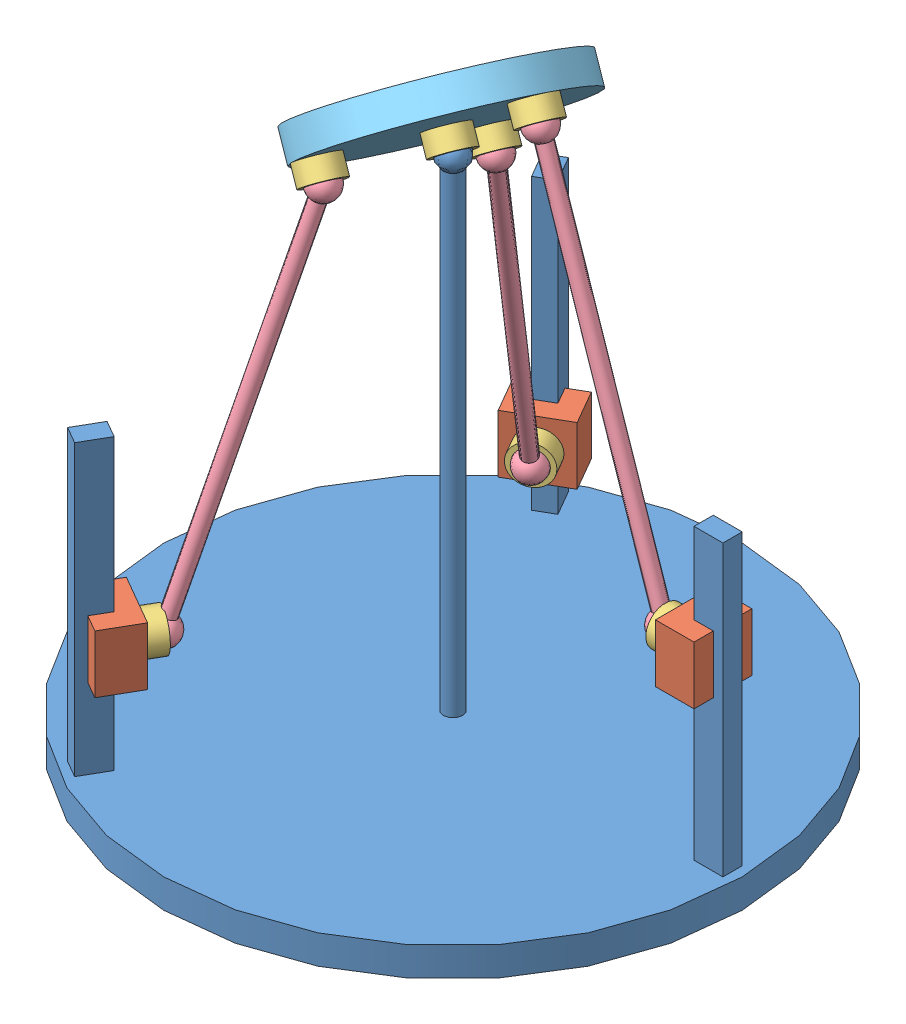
SolidWorks assembly 3Dchmech.SLDASM, configuration ﾃﾞﾌｫﾙﾄ (file format 4400). Lengths in mm.
Overall size (600 673.39 600).
16 component instances, 5 part files, 19 mates.
Components (placement in the parent):
- Base-1: Base.SLDPRT [ﾃﾞﾌｫﾙﾄ] at (-44.9776 -329.6553 0) size (600 545 600)
- Slider-1: Slider.SLDPRT [ﾃﾞﾌｫﾙﾄ] at (-190.9583 -156.9636 192.8461) x (0.866025 0 0.5) z (0 -1 0) size (60 40 60)
- Slider-2: Slider.SLDPRT [ﾃﾞﾌｫﾙﾄ] at (-190.9583 -259.8836 -192.8461) x (0.866025 0 -0.5) z (0 1 0) size (60 40 60)
- Slider-3: Slider.SLDPRT [ﾃﾞﾌｫﾙﾄ] at (195.0224 -83.6858 30) x (0 0 -1) z (0 -1 0) size (60 40 60)
- Pivot-1: Pivot.SLDPRT [ﾃﾞﾌｫﾙﾄ] at (-169.9776 -229.8836 -216.5064) x (0.366012 -0.9063 -0.211317) z (-0.784879 -0.422634 0.45315) size (40 30 40)
- Pivot-2: Pivot.SLDPRT [ﾃﾞﾌｫﾙﾄ] at (-169.9776 -186.9636 216.5064) x (-0.688455 -0.606662 -0.39748) z (0.525385 -0.79496 0.303331) size (40 30 40)
- Pivot-3: Pivot.SLDPRT [ﾃﾞﾌｫﾙﾄ] at (205.0224 -113.6858 0) x (0 1 0) z (0 0 1) size (40 30 40)
- Rod-4: Rod.SLDPRT [ﾃﾞﾌｫﾙﾄ] at (-154.9084 -186.9636 190.4057) x (0.846146 -0.265115 -0.462333) z (0.508445 0.141525 0.849384) size (30 430 30)
- Rod-5: Rod.SLDPRT [ﾃﾞﾌｫﾙﾄ] at (174.884 -113.6858 0) x (0.77564 0.274521 -0.568349) z (0.523866 0.222265 0.822291) size (30 430 30)
- Rod-6: Rod.SLDPRT [ﾃﾞﾌｫﾙﾄ] at (-154.9084 -229.8836 -190.4057) x (0.91735 -0.2746 0.288208) z (-0.348549 -0.204307 0.914752) size (30 430 30)
- Movingplate-1: Movingplate.SLDASM [ﾃﾞﾌｫﾙﾄ] at (-128.1031 258.7204 3.5111) x (-0.653789 -0.280732 0.702673) z (-0.45045 -0.601762 -0.659528) size (242.17 50 246.74)
  - Movingplate-1: Movingplate.SLDPRT [ﾃﾞﾌｫﾙﾄ] at (-40.4258 -73.1121 0) size (240 30 240)
  - Pivot-1: Pivot.SLDPRT [ﾃﾞﾌｫﾙﾄ] at (53.5434 -63.1121 -34.202) x (-0.760585 0 -0.649239) z (-0.649239 0 0.760585) size (40 30 40)
  - Pivot-2: Pivot.SLDPRT [ﾃﾞﾌｫﾙﾄ] at (-57.7906 -63.1121 98.4808) x (-0.73699 0 -0.675903) z (-0.675903 0 0.73699) size (40 30 40)
  - Pivot-3: Pivot.SLDPRT [ﾃﾞﾌｫﾙﾄ] at (-117.0303 -63.1121 -64.2788) x (-0.704167 0 0.710034) z (0.710034 0 0.704167) size (40 30 40)
  - Pivot-4: Pivot.SLDPRT [ﾃﾞﾌｫﾙﾄ] at (-40.4258 -63.1121 0) x (-0.837169 0 -0.546944) z (-0.546944 0 0.837169) size (40 30 40)
Mates (geometry in assembly coordinates):
- 一致1: coincident anti-aligned: plane of Slider-2 through (-183.6378 -199.8836 -220.1666) normal (-0.5 0 -0.866025); plane of Base-1 through (-166.3173 0.3447 -230.1666) normal (0.5 0 0.866025)
- 一致2: coincident anti-aligned: plane of Base-1 through (-183.6378 0.3447 -220.1666) normal (-0.866025 0 0.5); plane of Slider-2 through (-193.6378 -199.8836 -237.4871) normal (0.866025 0 -0.5)
- 一致3: coincident anti-aligned: plane of Base-1 through (-183.6378 0.3447 220.1666) normal (0.5 0 -0.866025); plane of Slider-1 through (-183.6378 -216.9636 220.1666) normal (-0.5 0 0.866025)
- 一致4: coincident anti-aligned: plane of Base-1 through (-166.3173 0.3447 230.1666) normal (0.866025 0 0.5); plane of Slider-1 through (-166.3173 -216.9636 230.1666) normal (-0.866025 0 -0.5)
- 一致5: coincident anti-aligned: plane of Slider-3 through (215.0224 -143.6858 10) normal (1 0 0); plane of Base-1 through (215.0224 0.3447 10) normal (-1 0 0)
- 一致6: coincident anti-aligned: plane of Base-1 through (215.0224 0.3447 10) normal (0 0 1); plane of Slider-3 through (235.0224 -143.6858 10) normal (0 0 -1)
- 同心円1: concentric anti-aligned: cylinder of Slider-3 through (210.0224 -113.6858 0) axis (-1 0 0) radius 10; cylinder of Pivot-3 through (230.1504 -113.6858 0) axis (1 0 0) radius 10
- 一致7: coincident anti-aligned: plane of Slider-3 through (195.0224 -143.6858 -30) normal (-1 0 0); plane of Pivot-3 through (195.0224 -103.6858 0) normal (1 0 0)
- 同心円2: concentric anti-aligned: cylinder of Slider-2 through (-172.4776 -229.8836 -220.8365) axis (0.5 0 0.866025) radius 10; cylinder of Pivot-1 through (-182.5416 -229.8836 -238.2679) axis (-0.5 0 -0.866025) radius 10
- 一致8: coincident anti-aligned: plane of Slider-2 through (-138.9968 -199.8836 -222.8461) normal (0.5 0 0.866025); plane of Pivot-1 through (-161.3175 -238.9466 -209.9593) normal (-0.5 0 -0.866025)
- 同心円3: concentric anti-aligned: cylinder of Slider-1 through (-172.4776 -186.9636 220.8365) axis (0.5 0 -0.866025) radius 10; cylinder of Pivot-2 through (-182.5416 -186.9636 238.2679) axis (-0.5 0 0.866025) radius 10
- 一致9: coincident anti-aligned: plane of Slider-1 through (-138.9968 -216.9636 222.8461) normal (0.5 0 -0.866025); plane of Pivot-2 through (-171.8621 -193.0302 203.8713) normal (-0.5 0 0.866025)
- 同心円4: concentric: sphere of Pivot-2; sphere of Rod-4
- 同心円5: concentric: sphere of Pivot-3; sphere of Rod-5
- 同心円6: concentric: sphere of Pivot-1; sphere of Rod-6
- 同心円10: concentric: sphere of Base-1; sphere of Movingplate-1/Pivot-4
- 同心円11: concentric: sphere of Rod-6; sphere of Movingplate-1/Pivot-2
- 同心円12: concentric: sphere of Rod-4; sphere of Movingplate-1/Pivot-1
- 同心円13: concentric: sphere of Rod-5; sphere of Movingplate-1/Pivot-3
